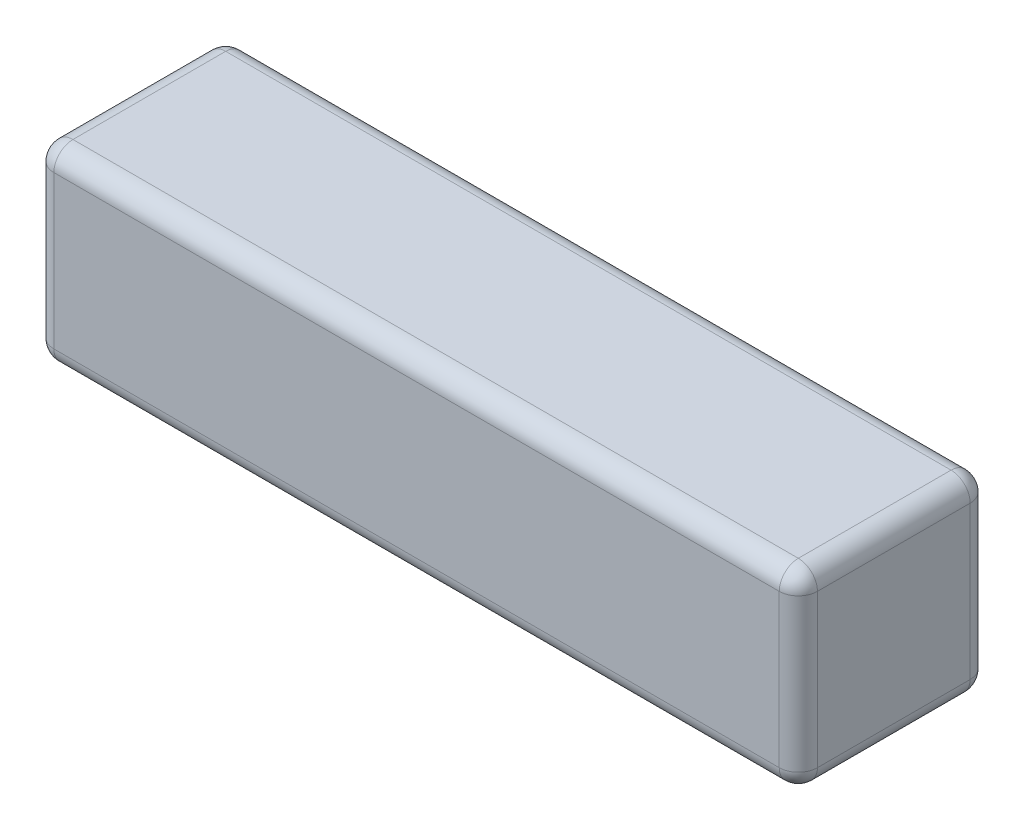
from build123d import *

# Parameters (mm, degrees)
BOSS_EXTRUDE1_DEPTH = 100
FILLET3_R           = 10


with BuildPart() as part:
    # Sketch1 → Boss-Extrude1 (new body)
    with BuildSketch(Plane.XY):
        Polygon((-26.4, 14.740311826), (73.6, 14.740311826), (73.6, 114.740311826), (-326.4, 114.740311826), (-326.4, 14.740311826), align=None)
    extrude(amount=BOSS_EXTRUDE1_DEPTH)

    # Fillet3
    fillet3_edges = [part.edges().sort_by_distance(p)[0] for p in [
        (73.6, 64.740311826, 100),
        (-126.4, 114.740311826, 100),
        (-326.4, 64.740311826, 100),
        (-126.4, 114.740311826, 0),
        (73.6, 64.740311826, 0),
        (-126.4, 14.740311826, 0),
        (-326.4, 64.740311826, 0),
        (-126.4, 14.740311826, 100),
        (-326.4, 114.740311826, 50),
        (73.6, 114.740311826, 50),
        (73.6, 14.740311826, 50),
        (-326.4, 14.740311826, 50),
    ]]
    fillet(fillet3_edges, radius=FILLET3_R)


solid = part.part
